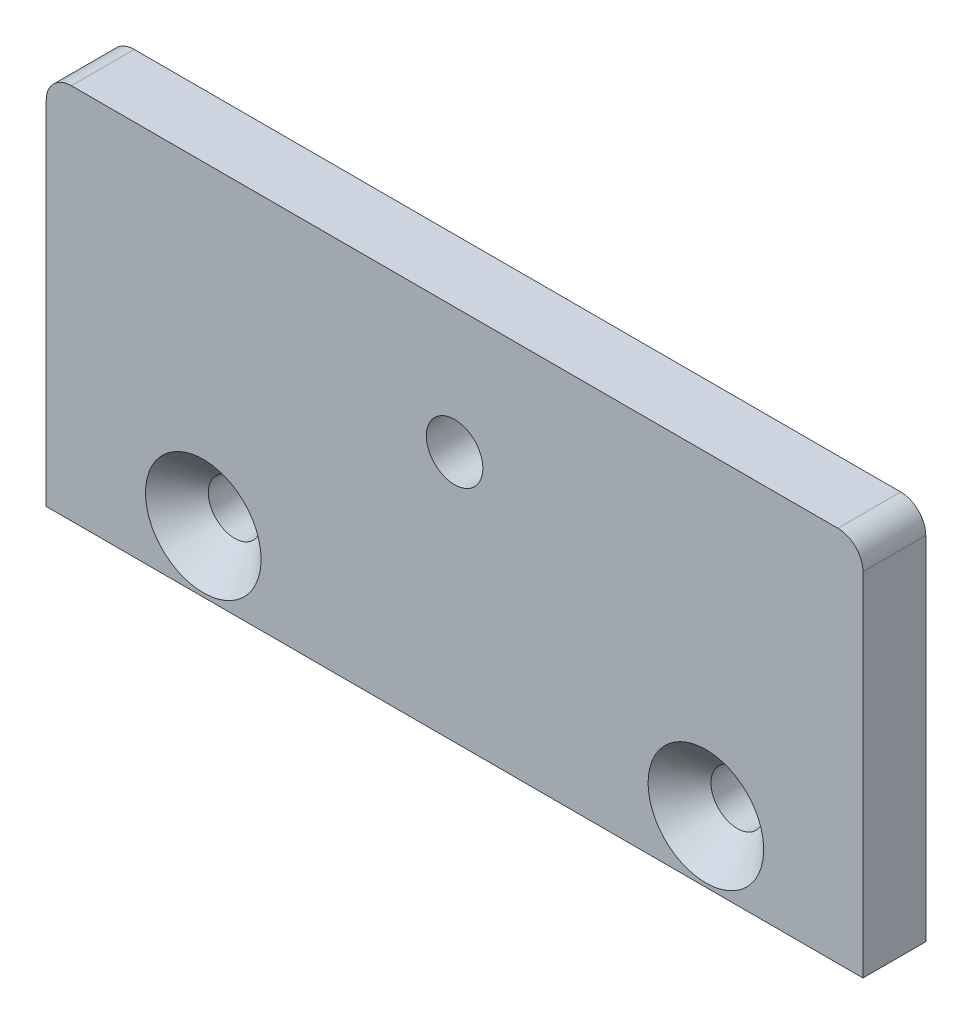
ISO-10303-21;
HEADER;
FILE_DESCRIPTION(('STEP AP214'),'2;1');
FILE_NAME('part.step','',(''),(''),'','','');
FILE_SCHEMA(('AUTOMOTIVE_DESIGN { 1 0 10303 214 1 1 1 1 }'));
ENDSEC;
DATA;
#1=APPLICATION_CONTEXT('core data for automotive mechanical design processes');
#2=APPLICATION_PROTOCOL_DEFINITION('international standard','automotive_design',2000,#1);
#3=PRODUCT_CONTEXT('',#1,'mechanical');
#4=PRODUCT('Part','Part','',(#3));
#5=PRODUCT_RELATED_PRODUCT_CATEGORY('part','',(#4));
#6=PRODUCT_DEFINITION_FORMATION('','',#4);
#7=PRODUCT_DEFINITION_CONTEXT('part definition',#1,'design');
#8=PRODUCT_DEFINITION('design','',#6,#7);
#9=PRODUCT_DEFINITION_SHAPE('','',#8);
#10=(LENGTH_UNIT() NAMED_UNIT(*) SI_UNIT(.MILLI.,.METRE.));
#11=(NAMED_UNIT(*) PLANE_ANGLE_UNIT() SI_UNIT($,.RADIAN.));
#12=(NAMED_UNIT(*) SI_UNIT($,.STERADIAN.) SOLID_ANGLE_UNIT());
#13=UNCERTAINTY_MEASURE_WITH_UNIT(LENGTH_MEASURE(1.E-05),#10,'distance_accuracy_value','');
#14=(GEOMETRIC_REPRESENTATION_CONTEXT(3) GLOBAL_UNCERTAINTY_ASSIGNED_CONTEXT((#13)) GLOBAL_UNIT_ASSIGNED_CONTEXT((#10,
#11,#12)) REPRESENTATION_CONTEXT('',''));
#15=CARTESIAN_POINT('',(0.,0.,0.));
#16=DIRECTION('',(0.,0.,1.));
#17=DIRECTION('',(1.,0.,0.));
#18=AXIS2_PLACEMENT_3D('',#15,#16,#17);
#19=CARTESIAN_POINT('',(0.,0.,10.));
#20=DIRECTION('',(0.,0.,-1.));
#21=DIRECTION('',(-1.,0.,0.));
#22=AXIS2_PLACEMENT_3D('',#19,#20,#21);
#23=PLANE('',#22);
#24=CARTESIAN_POINT('',(105.,9.8,10.));
#25=DIRECTION('',(0.,0.,-1.));
#26=DIRECTION('',(-1.,0.,0.));
#27=AXIS2_PLACEMENT_3D('',#24,#25,#26);
#28=CIRCLE('',#27,9.20000000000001);
#29=CARTESIAN_POINT('',(95.8,9.8,10.));
#30=VERTEX_POINT('',#29);
#31=EDGE_CURVE('E119',#30,#30,#28,.T.);
#32=ORIENTED_EDGE('',*,*,#31,.T.);
#33=EDGE_LOOP('',(#32));
#34=FACE_BOUND('',#33,.T.);
#35=CARTESIAN_POINT('',(25.,9.8,10.));
#36=DIRECTION('',(0.,0.,-1.));
#37=DIRECTION('',(-1.,0.,0.));
#38=AXIS2_PLACEMENT_3D('',#35,#36,#37);
#39=CIRCLE('',#38,9.20000000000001);
#40=CARTESIAN_POINT('',(15.8,9.8,10.));
#41=VERTEX_POINT('',#40);
#42=EDGE_CURVE('E111',#41,#41,#39,.T.);
#43=ORIENTED_EDGE('',*,*,#42,.T.);
#44=EDGE_LOOP('',(#43));
#45=FACE_BOUND('',#44,.T.);
#46=DIRECTION('',(0.,1.,0.));
#47=VECTOR('',#46,1.);
#48=CARTESIAN_POINT('',(130.,0.,10.));
#49=LINE('',#48,#47);
#50=CARTESIAN_POINT('',(130.,0.,10.));
#51=VERTEX_POINT('',#50);
#52=CARTESIAN_POINT('',(130.,56.,10.));
#53=VERTEX_POINT('',#52);
#54=EDGE_CURVE('E102',#51,#53,#49,.T.);
#55=ORIENTED_EDGE('',*,*,#54,.T.);
#56=CARTESIAN_POINT('',(126.,56.,10.));
#57=DIRECTION('',(0.,0.,-1.));
#58=DIRECTION('',(-1.,0.,0.));
#59=AXIS2_PLACEMENT_3D('',#56,#57,#58);
#60=CIRCLE('',#59,4.);
#61=CARTESIAN_POINT('',(126.,60.,10.));
#62=VERTEX_POINT('',#61);
#63=EDGE_CURVE('E41',#53,#62,#60,.F.);
#64=ORIENTED_EDGE('',*,*,#63,.T.);
#65=DIRECTION('',(-1.,0.,0.));
#66=VECTOR('',#65,1.);
#67=CARTESIAN_POINT('',(0.,60.,10.));
#68=LINE('',#67,#66);
#69=CARTESIAN_POINT('',(4.,60.,10.));
#70=VERTEX_POINT('',#69);
#71=EDGE_CURVE('E113',#62,#70,#68,.T.);
#72=ORIENTED_EDGE('',*,*,#71,.T.);
#73=CARTESIAN_POINT('',(4.,56.,10.));
#74=DIRECTION('',(0.,0.,-1.));
#75=DIRECTION('',(-1.,0.,0.));
#76=AXIS2_PLACEMENT_3D('',#73,#74,#75);
#77=CIRCLE('',#76,4.);
#78=CARTESIAN_POINT('',(0.,56.,10.));
#79=VERTEX_POINT('',#78);
#80=EDGE_CURVE('E48',#70,#79,#77,.F.);
#81=ORIENTED_EDGE('',*,*,#80,.T.);
#82=DIRECTION('',(0.,-1.,0.));
#83=VECTOR('',#82,1.);
#84=CARTESIAN_POINT('',(0.,0.,10.));
#85=LINE('',#84,#83);
#86=CARTESIAN_POINT('',(0.,0.,10.));
#87=VERTEX_POINT('',#86);
#88=EDGE_CURVE('E86',#79,#87,#85,.T.);
#89=ORIENTED_EDGE('',*,*,#88,.T.);
#90=DIRECTION('',(1.,0.,0.));
#91=VECTOR('',#90,1.);
#92=CARTESIAN_POINT('',(0.,0.,10.));
#93=LINE('',#92,#91);
#94=EDGE_CURVE('E89',#87,#51,#93,.T.);
#95=ORIENTED_EDGE('',*,*,#94,.T.);
#96=EDGE_LOOP('',(#55,#64,#72,#81,#89,#95));
#97=FACE_BOUND('',#96,.T.);
#98=CARTESIAN_POINT('',(65.,40.,10.));
#99=DIRECTION('',(0.,0.,1.));
#100=DIRECTION('',(1.,0.,0.));
#101=AXIS2_PLACEMENT_3D('',#98,#99,#100);
#102=CIRCLE('',#101,4.50000000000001);
#103=CARTESIAN_POINT('',(69.5,40.,10.));
#104=VERTEX_POINT('',#103);
#105=EDGE_CURVE('E156',#104,#104,#102,.T.);
#106=ORIENTED_EDGE('',*,*,#105,.F.);
#107=EDGE_LOOP('',(#106));
#108=FACE_BOUND('',#107,.T.);
#109=ADVANCED_FACE('F33',(#34,#45,#97,#108),#23,.F.);
#110=CARTESIAN_POINT('',(0.,0.,0.));
#111=DIRECTION('',(0.,0.,-1.));
#112=DIRECTION('',(-1.,0.,0.));
#113=AXIS2_PLACEMENT_3D('',#110,#111,#112);
#114=PLANE('',#113);
#115=CARTESIAN_POINT('',(25.,9.8,0.));
#116=DIRECTION('',(0.,0.,1.));
#117=DIRECTION('',(1.,0.,0.));
#118=AXIS2_PLACEMENT_3D('',#115,#116,#117);
#119=CIRCLE('',#118,4.2);
#120=CARTESIAN_POINT('',(29.2,9.8,0.));
#121=VERTEX_POINT('',#120);
#122=EDGE_CURVE('E162',#121,#121,#119,.T.);
#123=ORIENTED_EDGE('',*,*,#122,.T.);
#124=EDGE_LOOP('',(#123));
#125=FACE_BOUND('',#124,.T.);
#126=DIRECTION('',(-1.,0.,0.));
#127=VECTOR('',#126,1.);
#128=CARTESIAN_POINT('',(0.,60.,0.));
#129=LINE('',#128,#127);
#130=CARTESIAN_POINT('',(126.,60.,0.));
#131=VERTEX_POINT('',#130);
#132=CARTESIAN_POINT('',(4.,60.,0.));
#133=VERTEX_POINT('',#132);
#134=EDGE_CURVE('E94',#131,#133,#129,.T.);
#135=ORIENTED_EDGE('',*,*,#134,.F.);
#136=CARTESIAN_POINT('',(126.,56.,0.));
#137=DIRECTION('',(0.,0.,-1.));
#138=DIRECTION('',(-1.,0.,0.));
#139=AXIS2_PLACEMENT_3D('',#136,#137,#138);
#140=CIRCLE('',#139,4.);
#141=CARTESIAN_POINT('',(130.,56.,0.));
#142=VERTEX_POINT('',#141);
#143=EDGE_CURVE('E132',#131,#142,#140,.T.);
#144=ORIENTED_EDGE('',*,*,#143,.T.);
#145=DIRECTION('',(0.,1.,0.));
#146=VECTOR('',#145,1.);
#147=CARTESIAN_POINT('',(130.,0.,0.));
#148=LINE('',#147,#146);
#149=CARTESIAN_POINT('',(130.,0.,0.));
#150=VERTEX_POINT('',#149);
#151=EDGE_CURVE('E150',#150,#142,#148,.T.);
#152=ORIENTED_EDGE('',*,*,#151,.F.);
#153=DIRECTION('',(1.,0.,0.));
#154=VECTOR('',#153,1.);
#155=CARTESIAN_POINT('',(0.,0.,0.));
#156=LINE('',#155,#154);
#157=CARTESIAN_POINT('',(0.,0.,0.));
#158=VERTEX_POINT('',#157);
#159=EDGE_CURVE('E152',#158,#150,#156,.T.);
#160=ORIENTED_EDGE('',*,*,#159,.F.);
#161=DIRECTION('',(0.,-1.,0.));
#162=VECTOR('',#161,1.);
#163=CARTESIAN_POINT('',(0.,0.,0.));
#164=LINE('',#163,#162);
#165=CARTESIAN_POINT('',(0.,56.,0.));
#166=VERTEX_POINT('',#165);
#167=EDGE_CURVE('E106',#166,#158,#164,.T.);
#168=ORIENTED_EDGE('',*,*,#167,.F.);
#169=CARTESIAN_POINT('',(4.,56.,0.));
#170=DIRECTION('',(0.,0.,-1.));
#171=DIRECTION('',(-1.,0.,0.));
#172=AXIS2_PLACEMENT_3D('',#169,#170,#171);
#173=CIRCLE('',#172,4.);
#174=EDGE_CURVE('E130',#166,#133,#173,.T.);
#175=ORIENTED_EDGE('',*,*,#174,.T.);
#176=EDGE_LOOP('',(#135,#144,#152,#160,#168,#175));
#177=FACE_BOUND('',#176,.T.);
#178=CARTESIAN_POINT('',(65.,40.,0.));
#179=DIRECTION('',(0.,0.,1.));
#180=DIRECTION('',(1.,0.,0.));
#181=AXIS2_PLACEMENT_3D('',#178,#179,#180);
#182=CIRCLE('',#181,4.50000000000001);
#183=CARTESIAN_POINT('',(69.5,40.,0.));
#184=VERTEX_POINT('',#183);
#185=EDGE_CURVE('E159',#184,#184,#182,.T.);
#186=ORIENTED_EDGE('',*,*,#185,.T.);
#187=EDGE_LOOP('',(#186));
#188=FACE_BOUND('',#187,.T.);
#189=CARTESIAN_POINT('',(105.,9.8,0.));
#190=DIRECTION('',(0.,0.,1.));
#191=DIRECTION('',(1.,0.,0.));
#192=AXIS2_PLACEMENT_3D('',#189,#190,#191);
#193=CIRCLE('',#192,4.19999999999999);
#194=CARTESIAN_POINT('',(109.2,9.8,0.));
#195=VERTEX_POINT('',#194);
#196=EDGE_CURVE('E167',#195,#195,#193,.T.);
#197=ORIENTED_EDGE('',*,*,#196,.T.);
#198=EDGE_LOOP('',(#197));
#199=FACE_BOUND('',#198,.T.);
#200=ADVANCED_FACE('F148',(#125,#177,#188,#199),#114,.T.);
#201=CARTESIAN_POINT('',(0.,0.,10.));
#202=DIRECTION('',(1.,0.,0.));
#203=DIRECTION('',(0.,0.,-1.));
#204=AXIS2_PLACEMENT_3D('',#201,#202,#203);
#205=PLANE('',#204);
#206=ORIENTED_EDGE('',*,*,#88,.F.);
#207=DIRECTION('',(0.,0.,-1.));
#208=VECTOR('',#207,1.);
#209=CARTESIAN_POINT('',(0.,56.,10.));
#210=LINE('',#209,#208);
#211=EDGE_CURVE('E11',#79,#166,#210,.T.);
#212=ORIENTED_EDGE('',*,*,#211,.T.);
#213=ORIENTED_EDGE('',*,*,#167,.T.);
#214=DIRECTION('',(0.,0.,-1.));
#215=VECTOR('',#214,1.);
#216=CARTESIAN_POINT('',(0.,0.,10.));
#217=LINE('',#216,#215);
#218=EDGE_CURVE('E99',#87,#158,#217,.T.);
#219=ORIENTED_EDGE('',*,*,#218,.F.);
#220=EDGE_LOOP('',(#206,#212,#213,#219));
#221=FACE_BOUND('',#220,.T.);
#222=ADVANCED_FACE('F104',(#221),#205,.F.);
#223=CARTESIAN_POINT('',(0.,0.,10.));
#224=DIRECTION('',(0.,1.,0.));
#225=DIRECTION('',(0.,0.,1.));
#226=AXIS2_PLACEMENT_3D('',#223,#224,#225);
#227=PLANE('',#226);
#228=ORIENTED_EDGE('',*,*,#159,.T.);
#229=DIRECTION('',(0.,0.,-1.));
#230=VECTOR('',#229,1.);
#231=CARTESIAN_POINT('',(130.,0.,10.));
#232=LINE('',#231,#230);
#233=EDGE_CURVE('E101',#51,#150,#232,.T.);
#234=ORIENTED_EDGE('',*,*,#233,.F.);
#235=ORIENTED_EDGE('',*,*,#94,.F.);
#236=ORIENTED_EDGE('',*,*,#218,.T.);
#237=EDGE_LOOP('',(#228,#234,#235,#236));
#238=FACE_BOUND('',#237,.T.);
#239=ADVANCED_FACE('F98',(#238),#227,.F.);
#240=CARTESIAN_POINT('',(130.,0.,10.));
#241=DIRECTION('',(-1.,0.,0.));
#242=DIRECTION('',(0.,0.,1.));
#243=AXIS2_PLACEMENT_3D('',#240,#241,#242);
#244=PLANE('',#243);
#245=ORIENTED_EDGE('',*,*,#151,.T.);
#246=DIRECTION('',(0.,0.,-1.));
#247=VECTOR('',#246,1.);
#248=CARTESIAN_POINT('',(130.,56.,10.));
#249=LINE('',#248,#247);
#250=EDGE_CURVE('E56',#142,#53,#249,.F.);
#251=ORIENTED_EDGE('',*,*,#250,.T.);
#252=ORIENTED_EDGE('',*,*,#54,.F.);
#253=ORIENTED_EDGE('',*,*,#233,.T.);
#254=EDGE_LOOP('',(#245,#251,#252,#253));
#255=FACE_BOUND('',#254,.T.);
#256=ADVANCED_FACE('F151',(#255),#244,.F.);
#257=CARTESIAN_POINT('',(0.,60.,10.));
#258=DIRECTION('',(0.,-1.,0.));
#259=DIRECTION('',(0.,0.,-1.));
#260=AXIS2_PLACEMENT_3D('',#257,#258,#259);
#261=PLANE('',#260);
#262=ORIENTED_EDGE('',*,*,#71,.F.);
#263=DIRECTION('',(0.,0.,-1.));
#264=VECTOR('',#263,1.);
#265=CARTESIAN_POINT('',(126.,60.,10.));
#266=LINE('',#265,#264);
#267=EDGE_CURVE('E127',#62,#131,#266,.T.);
#268=ORIENTED_EDGE('',*,*,#267,.T.);
#269=ORIENTED_EDGE('',*,*,#134,.T.);
#270=DIRECTION('',(0.,0.,-1.));
#271=VECTOR('',#270,1.);
#272=CARTESIAN_POINT('',(4.,60.,10.));
#273=LINE('',#272,#271);
#274=EDGE_CURVE('E125',#133,#70,#273,.F.);
#275=ORIENTED_EDGE('',*,*,#274,.T.);
#276=EDGE_LOOP('',(#262,#268,#269,#275));
#277=FACE_BOUND('',#276,.T.);
#278=ADVANCED_FACE('F140',(#277),#261,.F.);
#279=CARTESIAN_POINT('',(65.,40.,10.));
#280=DIRECTION('',(0.,0.,-1.));
#281=DIRECTION('',(-1.,0.,0.));
#282=AXIS2_PLACEMENT_3D('',#279,#280,#281);
#283=CYLINDRICAL_SURFACE('',#282,4.50000000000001);
#284=ORIENTED_EDGE('',*,*,#105,.T.);
#285=EDGE_LOOP('',(#284));
#286=FACE_BOUND('',#285,.T.);
#287=ORIENTED_EDGE('',*,*,#185,.F.);
#288=EDGE_LOOP('',(#287));
#289=FACE_BOUND('',#288,.T.);
#290=ADVANCED_FACE('F185',(#286,#289),#283,.F.);
#291=CARTESIAN_POINT('',(25.,9.8,10.));
#292=DIRECTION('',(0.,0.,-1.));
#293=DIRECTION('',(-1.,0.,0.));
#294=AXIS2_PLACEMENT_3D('',#291,#292,#293);
#295=CYLINDRICAL_SURFACE('',#294,4.2);
#296=CARTESIAN_POINT('',(25.,9.8,5.));
#297=DIRECTION('',(0.,0.,-1.));
#298=DIRECTION('',(-1.,0.,0.));
#299=AXIS2_PLACEMENT_3D('',#296,#297,#298);
#300=CIRCLE('',#299,4.2);
#301=CARTESIAN_POINT('',(20.8,9.8,5.));
#302=VERTEX_POINT('',#301);
#303=EDGE_CURVE('E122',#302,#302,#300,.F.);
#304=ORIENTED_EDGE('',*,*,#303,.T.);
#305=EDGE_LOOP('',(#304));
#306=FACE_BOUND('',#305,.T.);
#307=ORIENTED_EDGE('',*,*,#122,.F.);
#308=EDGE_LOOP('',(#307));
#309=FACE_BOUND('',#308,.T.);
#310=ADVANCED_FACE('F175',(#306,#309),#295,.F.);
#311=CARTESIAN_POINT('',(105.,9.8,10.));
#312=DIRECTION('',(0.,0.,-1.));
#313=DIRECTION('',(-1.,0.,0.));
#314=AXIS2_PLACEMENT_3D('',#311,#312,#313);
#315=CYLINDRICAL_SURFACE('',#314,4.19999999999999);
#316=CARTESIAN_POINT('',(105.,9.8,4.99999999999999));
#317=DIRECTION('',(0.,0.,-1.));
#318=DIRECTION('',(-1.,0.,0.));
#319=AXIS2_PLACEMENT_3D('',#316,#317,#318);
#320=CIRCLE('',#319,4.19999999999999);
#321=CARTESIAN_POINT('',(100.8,9.8,4.99999999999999));
#322=VERTEX_POINT('',#321);
#323=EDGE_CURVE('E108',#322,#322,#320,.F.);
#324=ORIENTED_EDGE('',*,*,#323,.T.);
#325=EDGE_LOOP('',(#324));
#326=FACE_BOUND('',#325,.T.);
#327=ORIENTED_EDGE('',*,*,#196,.F.);
#328=EDGE_LOOP('',(#327));
#329=FACE_BOUND('',#328,.T.);
#330=ADVANCED_FACE('F172',(#326,#329),#315,.F.);
#331=CARTESIAN_POINT('',(105.,9.8,4.99999999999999));
#332=DIRECTION('',(0.,0.,1.));
#333=DIRECTION('',(1.,0.,0.));
#334=AXIS2_PLACEMENT_3D('',#331,#332,#333);
#335=CONICAL_SURFACE('',#334,4.19999999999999,0.78539816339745);
#336=ORIENTED_EDGE('',*,*,#31,.F.);
#337=EDGE_LOOP('',(#336));
#338=FACE_BOUND('',#337,.T.);
#339=ORIENTED_EDGE('',*,*,#323,.F.);
#340=EDGE_LOOP('',(#339));
#341=FACE_BOUND('',#340,.T.);
#342=ADVANCED_FACE('F174',(#338,#341),#335,.F.);
#343=CARTESIAN_POINT('',(25.,9.8,5.));
#344=DIRECTION('',(0.,0.,1.));
#345=DIRECTION('',(1.,0.,0.));
#346=AXIS2_PLACEMENT_3D('',#343,#344,#345);
#347=CONICAL_SURFACE('',#346,4.2,0.78539816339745);
#348=ORIENTED_EDGE('',*,*,#42,.F.);
#349=EDGE_LOOP('',(#348));
#350=FACE_BOUND('',#349,.T.);
#351=ORIENTED_EDGE('',*,*,#303,.F.);
#352=EDGE_LOOP('',(#351));
#353=FACE_BOUND('',#352,.T.);
#354=ADVANCED_FACE('F182',(#350,#353),#347,.F.);
#355=CARTESIAN_POINT('',(126.,56.,10.));
#356=DIRECTION('',(0.,0.,-1.));
#357=DIRECTION('',(-1.,0.,0.));
#358=AXIS2_PLACEMENT_3D('',#355,#356,#357);
#359=CYLINDRICAL_SURFACE('',#358,4.);
#360=ORIENTED_EDGE('',*,*,#63,.F.);
#361=ORIENTED_EDGE('',*,*,#250,.F.);
#362=ORIENTED_EDGE('',*,*,#143,.F.);
#363=ORIENTED_EDGE('',*,*,#267,.F.);
#364=EDGE_LOOP('',(#360,#361,#362,#363));
#365=FACE_BOUND('',#364,.T.);
#366=ADVANCED_FACE('F145',(#365),#359,.T.);
#367=CARTESIAN_POINT('',(4.,56.,10.));
#368=DIRECTION('',(0.,0.,-1.));
#369=DIRECTION('',(-1.,0.,0.));
#370=AXIS2_PLACEMENT_3D('',#367,#368,#369);
#371=CYLINDRICAL_SURFACE('',#370,4.);
#372=ORIENTED_EDGE('',*,*,#80,.F.);
#373=ORIENTED_EDGE('',*,*,#274,.F.);
#374=ORIENTED_EDGE('',*,*,#174,.F.);
#375=ORIENTED_EDGE('',*,*,#211,.F.);
#376=EDGE_LOOP('',(#372,#373,#374,#375));
#377=FACE_BOUND('',#376,.T.);
#378=ADVANCED_FACE('F35',(#377),#371,.T.);
#379=CLOSED_SHELL('',(#109,#200,#222,#239,#256,#278,#290,#310,#330,#342,#354,#366,#378));
#380=MANIFOLD_SOLID_BREP('B2',#379);
#381=ADVANCED_BREP_SHAPE_REPRESENTATION('',(#18,#380),#14);
#382=SHAPE_DEFINITION_REPRESENTATION(#9,#381);
ENDSEC;
END-ISO-10303-21;
